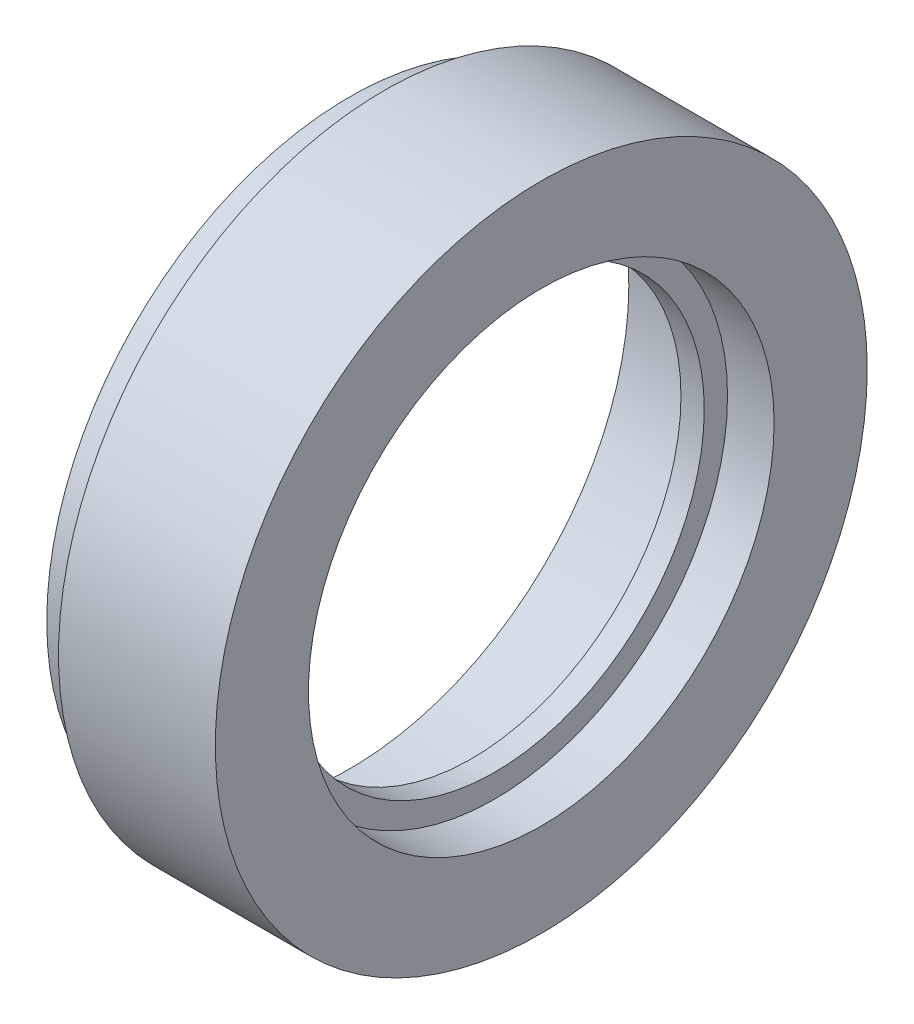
from build123d import *


with BuildPart() as part:
    # Sketch1 → Revolve1 (revolve)
    with BuildSketch(Plane.XY, mode=Mode.PRIVATE) as revolve1_sk:
        Polygon((0, 41.275), (0, 38.1), (16.637, 38.1), (16.637, 28.575), (19.812, 28.575), (19.812, 31.75), (26.162, 31.75), (26.162, 44.45), (4.7752, 44.45), (4.7752, 41.275), align=None)
    revolve(revolve1_sk.sketch.rotate(Axis((0, 0, 0), (-1, 0, 0)), 90), axis=Axis((0, 0, 0), (-1, 0, 0)))


solid = part.part
